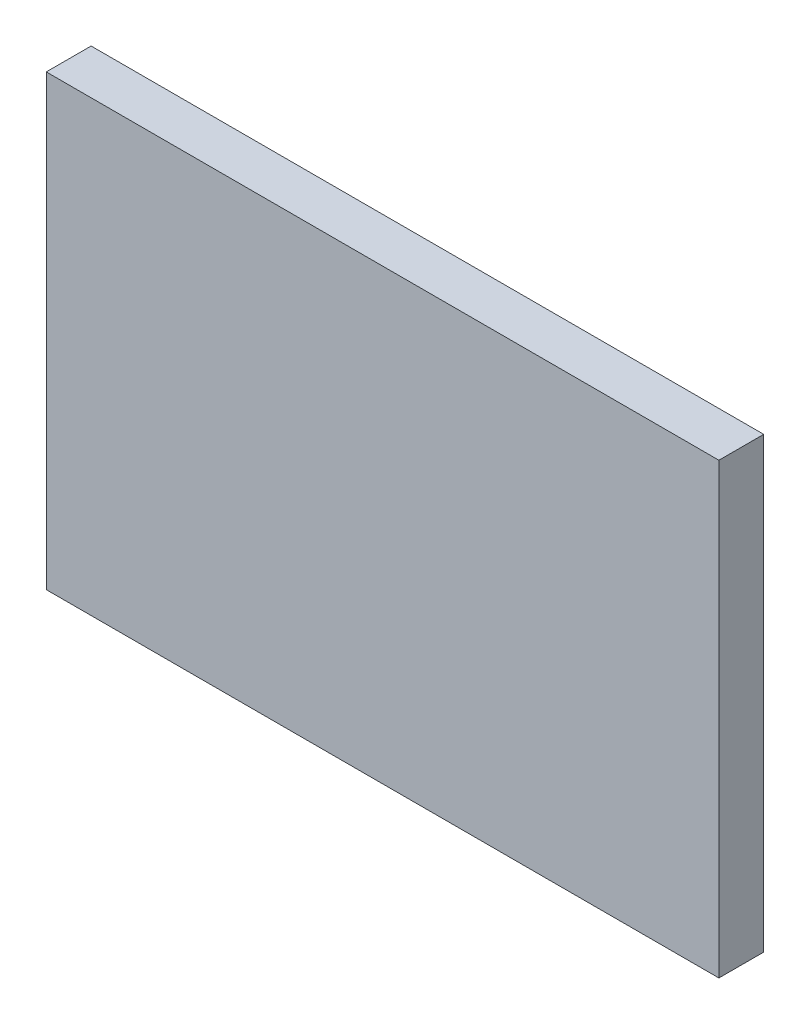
from build123d import *

# Parameters (mm, degrees)
SKETCH1_W           = 150
SKETCH1_H           = 100
BOSS_EXTRUDE1_DEPTH = 10


with BuildPart() as part:
    # Sketch1 → Boss-Extrude1 (new body)
    with BuildSketch(Plane.XY):
        with Locations((-20.394736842, 15.625)):
            Rectangle(SKETCH1_W, SKETCH1_H)
    extrude(amount=BOSS_EXTRUDE1_DEPTH)


solid = part.part
